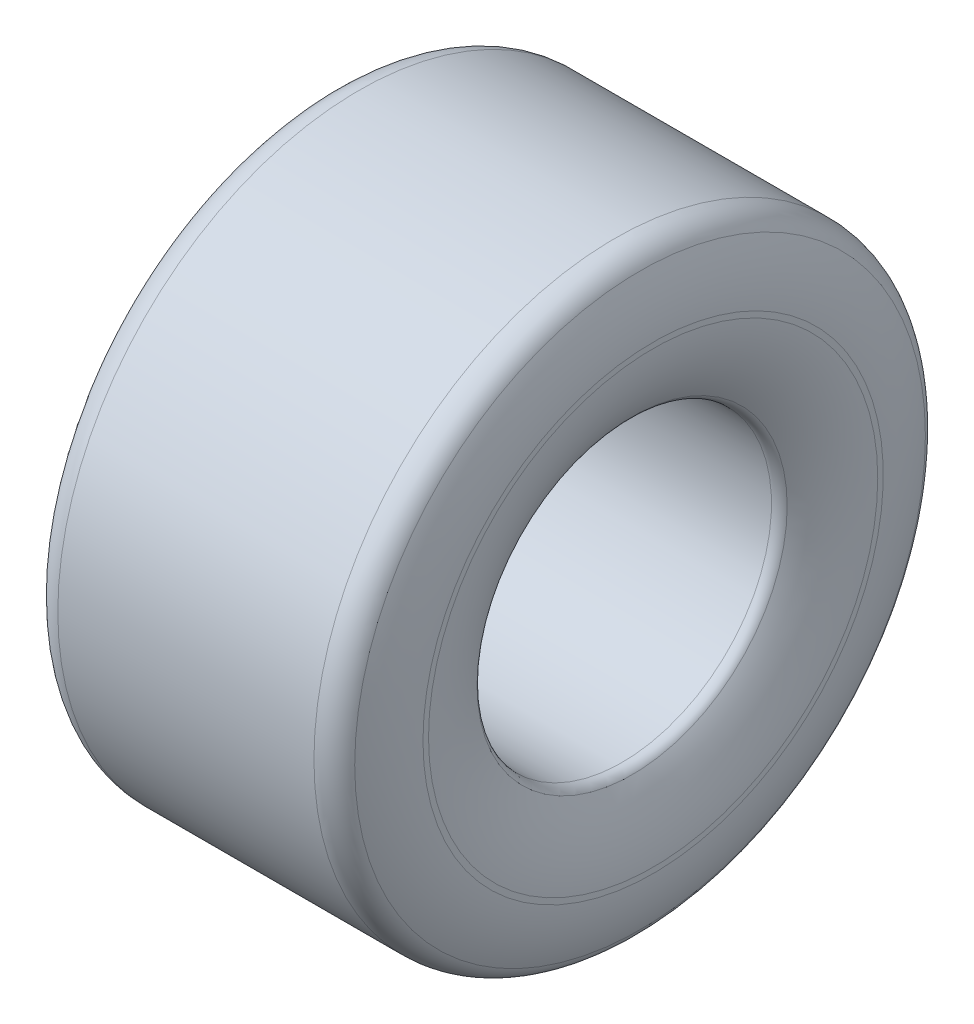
ISO-10303-21;
HEADER;
FILE_DESCRIPTION(('STEP AP214'),'2;1');
FILE_NAME('part.step','',(''),(''),'','','');
FILE_SCHEMA(('AUTOMOTIVE_DESIGN { 1 0 10303 214 1 1 1 1 }'));
ENDSEC;
DATA;
#1=APPLICATION_CONTEXT('core data for automotive mechanical design processes');
#2=APPLICATION_PROTOCOL_DEFINITION('international standard','automotive_design',2000,#1);
#3=PRODUCT_CONTEXT('',#1,'mechanical');
#4=PRODUCT('Part','Part','',(#3));
#5=PRODUCT_RELATED_PRODUCT_CATEGORY('part','',(#4));
#6=PRODUCT_DEFINITION_FORMATION('','',#4);
#7=PRODUCT_DEFINITION_CONTEXT('part definition',#1,'design');
#8=PRODUCT_DEFINITION('design','',#6,#7);
#9=PRODUCT_DEFINITION_SHAPE('','',#8);
#10=(LENGTH_UNIT() NAMED_UNIT(*) SI_UNIT(.MILLI.,.METRE.));
#11=(NAMED_UNIT(*) PLANE_ANGLE_UNIT() SI_UNIT($,.RADIAN.));
#12=(NAMED_UNIT(*) SI_UNIT($,.STERADIAN.) SOLID_ANGLE_UNIT());
#13=UNCERTAINTY_MEASURE_WITH_UNIT(LENGTH_MEASURE(1.E-05),#10,'distance_accuracy_value','');
#14=(GEOMETRIC_REPRESENTATION_CONTEXT(3) GLOBAL_UNCERTAINTY_ASSIGNED_CONTEXT((#13)) GLOBAL_UNIT_ASSIGNED_CONTEXT((#10,
#11,#12)) REPRESENTATION_CONTEXT('',''));
#15=CARTESIAN_POINT('',(0.,0.,0.));
#16=DIRECTION('',(0.,0.,1.));
#17=DIRECTION('',(1.,0.,0.));
#18=AXIS2_PLACEMENT_3D('',#15,#16,#17);
#19=CARTESIAN_POINT('',(-61.9125,0.,0.));
#20=DIRECTION('',(-1.,0.,0.));
#21=DIRECTION('',(0.,0.,1.));
#22=AXIS2_PLACEMENT_3D('',#19,#20,#21);
#23=TOROIDAL_SURFACE('',#22,74.0869413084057,5.50694130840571);
#24=CARTESIAN_POINT('',(-61.9125,0.,0.));
#25=DIRECTION('',(-1.,0.,0.));
#26=DIRECTION('',(0.,0.,1.));
#27=AXIS2_PLACEMENT_3D('',#24,#25,#26);
#28=CIRCLE('',#27,68.58);
#29=CARTESIAN_POINT('',(-61.9125,0.,68.58));
#30=VERTEX_POINT('',#29);
#31=EDGE_CURVE('E73',#30,#30,#28,.T.);
#32=ORIENTED_EDGE('',*,*,#31,.F.);
#33=EDGE_LOOP('',(#32));
#34=FACE_BOUND('',#33,.T.);
#35=CARTESIAN_POINT('',(-66.5589614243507,0.,0.));
#36=DIRECTION('',(-1.,0.,0.));
#37=DIRECTION('',(0.,0.,1.));
#38=AXIS2_PLACEMENT_3D('',#35,#36,#37);
#39=CIRCLE('',#38,71.1311336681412);
#40=CARTESIAN_POINT('',(-66.5589614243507,0.,71.1311336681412));
#41=VERTEX_POINT('',#40);
#42=EDGE_CURVE('E10',#41,#41,#39,.T.);
#43=ORIENTED_EDGE('',*,*,#42,.T.);
#44=EDGE_LOOP('',(#43));
#45=FACE_BOUND('',#44,.T.);
#46=ADVANCED_FACE('F33',(#34,#45),#23,.T.);
#47=CARTESIAN_POINT('',(-14.4283197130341,0.,0.));
#48=DIRECTION('',(-1.,0.,0.));
#49=DIRECTION('',(0.,0.,1.));
#50=AXIS2_PLACEMENT_3D('',#47,#48,#49);
#51=TOROIDAL_SURFACE('',#50,104.293606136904,61.7847342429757);
#52=ORIENTED_EDGE('',*,*,#42,.F.);
#53=EDGE_LOOP('',(#52));
#54=FACE_BOUND('',#53,.T.);
#55=CARTESIAN_POINT('',(-76.2,0.,0.));
#56=DIRECTION('',(-1.,0.,0.));
#57=DIRECTION('',(0.,0.,1.));
#58=AXIS2_PLACEMENT_3D('',#55,#56,#57);
#59=CIRCLE('',#58,103.023606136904);
#60=CARTESIAN_POINT('',(-76.2,0.,103.023606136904));
#61=VERTEX_POINT('',#60);
#62=EDGE_CURVE('E39',#61,#61,#59,.T.);
#63=ORIENTED_EDGE('',*,*,#62,.T.);
#64=EDGE_LOOP('',(#63));
#65=FACE_BOUND('',#64,.T.);
#66=ADVANCED_FACE('F80',(#54,#65),#51,.T.);
#67=CARTESIAN_POINT('',(-76.2,103.023606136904,0.));
#68=DIRECTION('',(1.,0.,0.));
#69=DIRECTION('',(0.,0.,-1.));
#70=AXIS2_PLACEMENT_3D('',#67,#68,#69);
#71=PLANE('',#70);
#72=ORIENTED_EDGE('',*,*,#62,.F.);
#73=EDGE_LOOP('',(#72));
#74=FACE_BOUND('',#73,.T.);
#75=CARTESIAN_POINT('',(-76.2,0.,0.));
#76=DIRECTION('',(-1.,0.,0.));
#77=DIRECTION('',(0.,0.,1.));
#78=AXIS2_PLACEMENT_3D('',#75,#76,#77);
#79=CIRCLE('',#78,105.563606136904);
#80=CARTESIAN_POINT('',(-76.2,0.,105.563606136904));
#81=VERTEX_POINT('',#80);
#82=EDGE_CURVE('E43',#81,#81,#79,.T.);
#83=ORIENTED_EDGE('',*,*,#82,.T.);
#84=EDGE_LOOP('',(#83));
#85=FACE_BOUND('',#84,.T.);
#86=ADVANCED_FACE('F84',(#74,#85),#71,.F.);
#87=CARTESIAN_POINT('',(-14.4283197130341,0.,0.));
#88=DIRECTION('',(-1.,0.,0.));
#89=DIRECTION('',(0.,0.,1.));
#90=AXIS2_PLACEMENT_3D('',#87,#88,#89);
#91=TOROIDAL_SURFACE('',#90,104.293606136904,61.7847342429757);
#92=ORIENTED_EDGE('',*,*,#82,.F.);
#93=EDGE_LOOP('',(#92));
#94=FACE_BOUND('',#93,.T.);
#95=CARTESIAN_POINT('',(-70.2018910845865,0.,0.));
#96=DIRECTION('',(-1.,0.,0.));
#97=DIRECTION('',(0.,0.,1.));
#98=AXIS2_PLACEMENT_3D('',#95,#96,#97);
#99=CIRCLE('',#98,130.87672337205);
#100=CARTESIAN_POINT('',(-70.2018910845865,0.,130.87672337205));
#101=VERTEX_POINT('',#100);
#102=EDGE_CURVE('E47',#101,#101,#99,.T.);
#103=ORIENTED_EDGE('',*,*,#102,.T.);
#104=EDGE_LOOP('',(#103));
#105=FACE_BOUND('',#104,.T.);
#106=ADVANCED_FACE('F89',(#94,#105),#91,.T.);
#107=CARTESIAN_POINT('',(-58.7375,0.,0.));
#108=DIRECTION('',(-1.,0.,0.));
#109=DIRECTION('',(0.,0.,1.));
#110=AXIS2_PLACEMENT_3D('',#107,#108,#109);
#111=TOROIDAL_SURFACE('',#110,125.4125,12.7);
#112=ORIENTED_EDGE('',*,*,#102,.F.);
#113=EDGE_LOOP('',(#112));
#114=FACE_BOUND('',#113,.T.);
#115=CARTESIAN_POINT('',(-58.7375,0.,0.));
#116=DIRECTION('',(-1.,0.,0.));
#117=DIRECTION('',(0.,0.,1.));
#118=AXIS2_PLACEMENT_3D('',#115,#116,#117);
#119=CIRCLE('',#118,138.1125);
#120=CARTESIAN_POINT('',(-58.7375,0.,138.1125));
#121=VERTEX_POINT('',#120);
#122=EDGE_CURVE('E52',#121,#121,#119,.T.);
#123=ORIENTED_EDGE('',*,*,#122,.T.);
#124=EDGE_LOOP('',(#123));
#125=FACE_BOUND('',#124,.T.);
#126=ADVANCED_FACE('F95',(#114,#125),#111,.T.);
#127=CARTESIAN_POINT('',(0.,0.,0.));
#128=DIRECTION('',(-1.,0.,0.));
#129=DIRECTION('',(0.,0.,1.));
#130=AXIS2_PLACEMENT_3D('',#127,#128,#129);
#131=CYLINDRICAL_SURFACE('',#130,138.1125);
#132=ORIENTED_EDGE('',*,*,#122,.F.);
#133=EDGE_LOOP('',(#132));
#134=FACE_BOUND('',#133,.T.);
#135=CARTESIAN_POINT('',(58.7375,0.,0.));
#136=DIRECTION('',(-1.,0.,0.));
#137=DIRECTION('',(0.,0.,1.));
#138=AXIS2_PLACEMENT_3D('',#135,#136,#137);
#139=CIRCLE('',#138,138.1125);
#140=CARTESIAN_POINT('',(58.7375,0.,138.1125));
#141=VERTEX_POINT('',#140);
#142=EDGE_CURVE('E55',#141,#141,#139,.T.);
#143=ORIENTED_EDGE('',*,*,#142,.T.);
#144=EDGE_LOOP('',(#143));
#145=FACE_BOUND('',#144,.T.);
#146=ADVANCED_FACE('F99',(#134,#145),#131,.T.);
#147=CARTESIAN_POINT('',(58.7375,0.,0.));
#148=DIRECTION('',(-1.,0.,0.));
#149=DIRECTION('',(0.,0.,1.));
#150=AXIS2_PLACEMENT_3D('',#147,#148,#149);
#151=TOROIDAL_SURFACE('',#150,125.4125,12.7);
#152=ORIENTED_EDGE('',*,*,#142,.F.);
#153=EDGE_LOOP('',(#152));
#154=FACE_BOUND('',#153,.T.);
#155=CARTESIAN_POINT('',(70.2018910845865,0.,0.));
#156=DIRECTION('',(-1.,0.,0.));
#157=DIRECTION('',(0.,0.,1.));
#158=AXIS2_PLACEMENT_3D('',#155,#156,#157);
#159=CIRCLE('',#158,130.87672337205);
#160=CARTESIAN_POINT('',(70.2018910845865,0.,130.87672337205));
#161=VERTEX_POINT('',#160);
#162=EDGE_CURVE('E58',#161,#161,#159,.T.);
#163=ORIENTED_EDGE('',*,*,#162,.T.);
#164=EDGE_LOOP('',(#163));
#165=FACE_BOUND('',#164,.T.);
#166=ADVANCED_FACE('F103',(#154,#165),#151,.T.);
#167=CARTESIAN_POINT('',(14.4283197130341,0.,0.));
#168=DIRECTION('',(-1.,0.,0.));
#169=DIRECTION('',(0.,0.,1.));
#170=AXIS2_PLACEMENT_3D('',#167,#168,#169);
#171=TOROIDAL_SURFACE('',#170,104.293606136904,61.7847342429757);
#172=ORIENTED_EDGE('',*,*,#162,.F.);
#173=EDGE_LOOP('',(#172));
#174=FACE_BOUND('',#173,.T.);
#175=CARTESIAN_POINT('',(76.2,0.,0.));
#176=DIRECTION('',(-1.,0.,0.));
#177=DIRECTION('',(0.,0.,1.));
#178=AXIS2_PLACEMENT_3D('',#175,#176,#177);
#179=CIRCLE('',#178,105.563606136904);
#180=CARTESIAN_POINT('',(76.2,0.,105.563606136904));
#181=VERTEX_POINT('',#180);
#182=EDGE_CURVE('E61',#181,#181,#179,.T.);
#183=ORIENTED_EDGE('',*,*,#182,.T.);
#184=EDGE_LOOP('',(#183));
#185=FACE_BOUND('',#184,.T.);
#186=ADVANCED_FACE('F107',(#174,#185),#171,.T.);
#187=CARTESIAN_POINT('',(76.2,103.023606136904,0.));
#188=DIRECTION('',(-1.,0.,0.));
#189=DIRECTION('',(0.,0.,1.));
#190=AXIS2_PLACEMENT_3D('',#187,#188,#189);
#191=PLANE('',#190);
#192=ORIENTED_EDGE('',*,*,#182,.F.);
#193=EDGE_LOOP('',(#192));
#194=FACE_BOUND('',#193,.T.);
#195=CARTESIAN_POINT('',(76.2,0.,0.));
#196=DIRECTION('',(-1.,0.,0.));
#197=DIRECTION('',(0.,0.,1.));
#198=AXIS2_PLACEMENT_3D('',#195,#196,#197);
#199=CIRCLE('',#198,103.023606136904);
#200=CARTESIAN_POINT('',(76.2,0.,103.023606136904));
#201=VERTEX_POINT('',#200);
#202=EDGE_CURVE('E64',#201,#201,#199,.T.);
#203=ORIENTED_EDGE('',*,*,#202,.T.);
#204=EDGE_LOOP('',(#203));
#205=FACE_BOUND('',#204,.T.);
#206=ADVANCED_FACE('F111',(#194,#205),#191,.F.);
#207=CARTESIAN_POINT('',(14.4283197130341,0.,0.));
#208=DIRECTION('',(-1.,0.,0.));
#209=DIRECTION('',(0.,0.,1.));
#210=AXIS2_PLACEMENT_3D('',#207,#208,#209);
#211=TOROIDAL_SURFACE('',#210,104.293606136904,61.7847342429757);
#212=ORIENTED_EDGE('',*,*,#202,.F.);
#213=EDGE_LOOP('',(#212));
#214=FACE_BOUND('',#213,.T.);
#215=CARTESIAN_POINT('',(66.5589614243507,0.,0.));
#216=DIRECTION('',(-1.,0.,0.));
#217=DIRECTION('',(0.,0.,1.));
#218=AXIS2_PLACEMENT_3D('',#215,#216,#217);
#219=CIRCLE('',#218,71.1311336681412);
#220=CARTESIAN_POINT('',(66.5589614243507,0.,71.1311336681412));
#221=VERTEX_POINT('',#220);
#222=EDGE_CURVE('E67',#221,#221,#219,.T.);
#223=ORIENTED_EDGE('',*,*,#222,.T.);
#224=EDGE_LOOP('',(#223));
#225=FACE_BOUND('',#224,.T.);
#226=ADVANCED_FACE('F115',(#214,#225),#211,.T.);
#227=CARTESIAN_POINT('',(61.9125,0.,0.));
#228=DIRECTION('',(-1.,0.,0.));
#229=DIRECTION('',(0.,0.,1.));
#230=AXIS2_PLACEMENT_3D('',#227,#228,#229);
#231=TOROIDAL_SURFACE('',#230,74.0869413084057,5.50694130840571);
#232=ORIENTED_EDGE('',*,*,#222,.F.);
#233=EDGE_LOOP('',(#232));
#234=FACE_BOUND('',#233,.T.);
#235=CARTESIAN_POINT('',(61.9125,0.,0.));
#236=DIRECTION('',(-1.,0.,0.));
#237=DIRECTION('',(0.,0.,1.));
#238=AXIS2_PLACEMENT_3D('',#235,#236,#237);
#239=CIRCLE('',#238,68.58);
#240=CARTESIAN_POINT('',(61.9125,0.,68.58));
#241=VERTEX_POINT('',#240);
#242=EDGE_CURVE('E70',#241,#241,#239,.T.);
#243=ORIENTED_EDGE('',*,*,#242,.T.);
#244=EDGE_LOOP('',(#243));
#245=FACE_BOUND('',#244,.T.);
#246=ADVANCED_FACE('F119',(#234,#245),#231,.T.);
#247=CARTESIAN_POINT('',(0.,0.,0.));
#248=DIRECTION('',(-1.,0.,0.));
#249=DIRECTION('',(0.,0.,1.));
#250=AXIS2_PLACEMENT_3D('',#247,#248,#249);
#251=CYLINDRICAL_SURFACE('',#250,68.58);
#252=ORIENTED_EDGE('',*,*,#242,.F.);
#253=EDGE_LOOP('',(#252));
#254=FACE_BOUND('',#253,.T.);
#255=ORIENTED_EDGE('',*,*,#31,.T.);
#256=EDGE_LOOP('',(#255));
#257=FACE_BOUND('',#256,.T.);
#258=ADVANCED_FACE('F77',(#254,#257),#251,.F.);
#259=CLOSED_SHELL('',(#46,#66,#86,#106,#126,#146,#166,#186,#206,#226,#246,#258));
#260=MANIFOLD_SOLID_BREP('B2',#259);
#261=ADVANCED_BREP_SHAPE_REPRESENTATION('',(#18,#260),#14);
#262=SHAPE_DEFINITION_REPRESENTATION(#9,#261);
ENDSEC;
END-ISO-10303-21;
